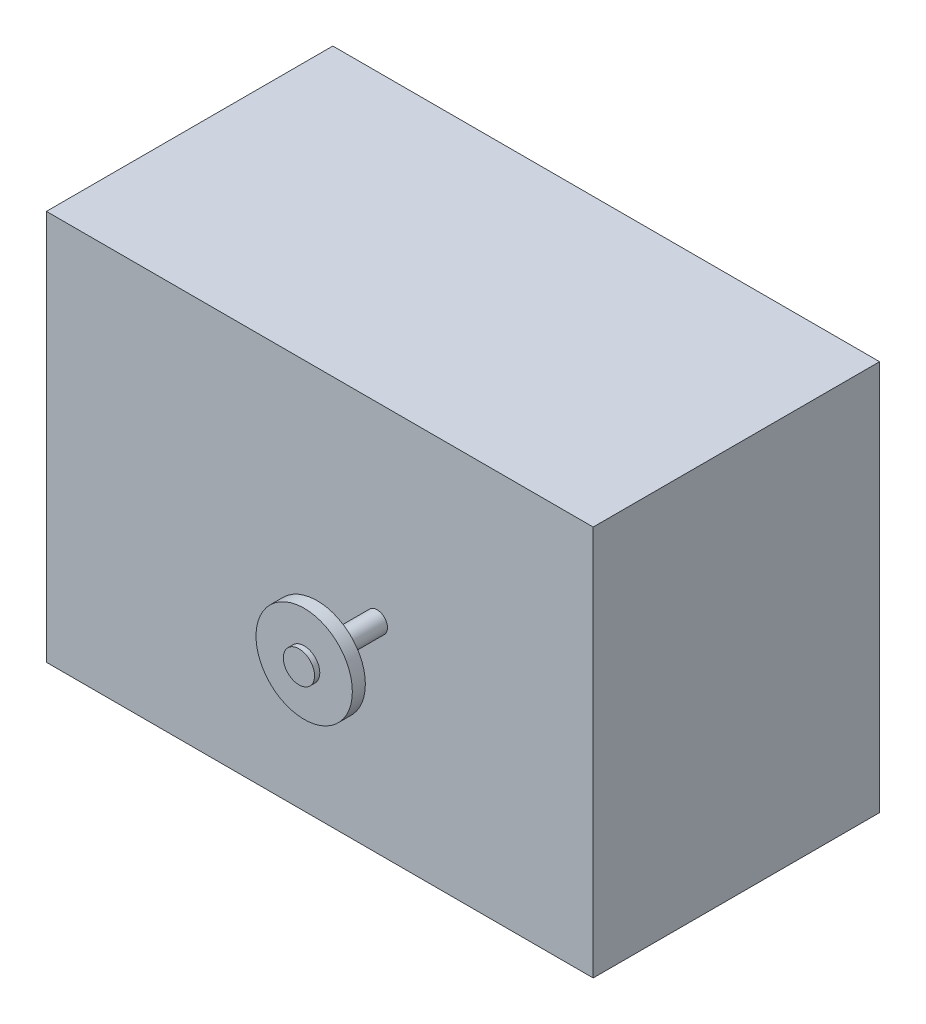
ISO-10303-21;
HEADER;
FILE_DESCRIPTION(('STEP AP214'),'2;1');
FILE_NAME('part.step','',(''),(''),'','','');
FILE_SCHEMA(('AUTOMOTIVE_DESIGN { 1 0 10303 214 1 1 1 1 }'));
ENDSEC;
DATA;
#1=APPLICATION_CONTEXT('core data for automotive mechanical design processes');
#2=APPLICATION_PROTOCOL_DEFINITION('international standard','automotive_design',2000,#1);
#3=PRODUCT_CONTEXT('',#1,'mechanical');
#4=PRODUCT('Part','Part','',(#3));
#5=PRODUCT_RELATED_PRODUCT_CATEGORY('part','',(#4));
#6=PRODUCT_DEFINITION_FORMATION('','',#4);
#7=PRODUCT_DEFINITION_CONTEXT('part definition',#1,'design');
#8=PRODUCT_DEFINITION('design','',#6,#7);
#9=PRODUCT_DEFINITION_SHAPE('','',#8);
#10=(LENGTH_UNIT() NAMED_UNIT(*) SI_UNIT(.MILLI.,.METRE.));
#11=(NAMED_UNIT(*) PLANE_ANGLE_UNIT() SI_UNIT($,.RADIAN.));
#12=(NAMED_UNIT(*) SI_UNIT($,.STERADIAN.) SOLID_ANGLE_UNIT());
#13=UNCERTAINTY_MEASURE_WITH_UNIT(LENGTH_MEASURE(1.E-05),#10,'distance_accuracy_value','');
#14=(GEOMETRIC_REPRESENTATION_CONTEXT(3) GLOBAL_UNCERTAINTY_ASSIGNED_CONTEXT((#13)) GLOBAL_UNIT_ASSIGNED_CONTEXT((#10,
#11,#12)) REPRESENTATION_CONTEXT('',''));
#15=CARTESIAN_POINT('',(0.,0.,0.));
#16=DIRECTION('',(0.,0.,1.));
#17=DIRECTION('',(1.,0.,0.));
#18=AXIS2_PLACEMENT_3D('',#15,#16,#17);
#19=CARTESIAN_POINT('',(22.,97.,50.5));
#20=DIRECTION('',(0.,0.,-1.));
#21=DIRECTION('',(-1.,0.,0.));
#22=AXIS2_PLACEMENT_3D('',#19,#20,#21);
#23=CYLINDRICAL_SURFACE('',#22,4.);
#24=CARTESIAN_POINT('',(22.,97.,22.5));
#25=DIRECTION('',(0.,0.,-1.));
#26=DIRECTION('',(-1.,0.,0.));
#27=AXIS2_PLACEMENT_3D('',#24,#25,#26);
#28=CIRCLE('',#27,4.);
#29=CARTESIAN_POINT('',(18.,97.,22.5));
#30=VERTEX_POINT('',#29);
#31=EDGE_CURVE('E111',#30,#30,#28,.F.);
#32=ORIENTED_EDGE('',*,*,#31,.T.);
#33=EDGE_LOOP('',(#32));
#34=FACE_BOUND('',#33,.T.);
#35=CARTESIAN_POINT('',(22.,97.,45.5));
#36=DIRECTION('',(0.,0.,1.));
#37=DIRECTION('',(1.,0.,0.));
#38=AXIS2_PLACEMENT_3D('',#35,#36,#37);
#39=CIRCLE('',#38,4.);
#40=CARTESIAN_POINT('',(26.,97.,45.5));
#41=VERTEX_POINT('',#40);
#42=EDGE_CURVE('E37',#41,#41,#39,.T.);
#43=ORIENTED_EDGE('',*,*,#42,.F.);
#44=EDGE_LOOP('',(#43));
#45=FACE_BOUND('',#44,.T.);
#46=ADVANCED_FACE('F33',(#34,#45),#23,.T.);
#47=CARTESIAN_POINT('',(-105.,170.,-87.5));
#48=DIRECTION('',(1.,0.,0.));
#49=DIRECTION('',(0.,0.,-1.));
#50=AXIS2_PLACEMENT_3D('',#47,#48,#49);
#51=PLANE('',#50);
#52=DIRECTION('',(0.,0.,1.));
#53=VECTOR('',#52,1.);
#54=CARTESIAN_POINT('',(-105.,20.,-87.5));
#55=LINE('',#54,#53);
#56=CARTESIAN_POINT('',(-105.,20.,-87.5));
#57=VERTEX_POINT('',#56);
#58=CARTESIAN_POINT('',(-105.,20.,22.5));
#59=VERTEX_POINT('',#58);
#60=EDGE_CURVE('E102',#57,#59,#55,.T.);
#61=ORIENTED_EDGE('',*,*,#60,.T.);
#62=DIRECTION('',(0.,-1.,0.));
#63=VECTOR('',#62,1.);
#64=CARTESIAN_POINT('',(-105.,170.,22.5));
#65=LINE('',#64,#63);
#66=CARTESIAN_POINT('',(-105.,170.,22.5));
#67=VERTEX_POINT('',#66);
#68=EDGE_CURVE('E93',#67,#59,#65,.T.);
#69=ORIENTED_EDGE('',*,*,#68,.F.);
#70=DIRECTION('',(0.,0.,1.));
#71=VECTOR('',#70,1.);
#72=CARTESIAN_POINT('',(-105.,170.,-87.5));
#73=LINE('',#72,#71);
#74=CARTESIAN_POINT('',(-105.,170.,-87.5));
#75=VERTEX_POINT('',#74);
#76=EDGE_CURVE('E87',#75,#67,#73,.T.);
#77=ORIENTED_EDGE('',*,*,#76,.F.);
#78=DIRECTION('',(0.,-1.,0.));
#79=VECTOR('',#78,1.);
#80=CARTESIAN_POINT('',(-105.,170.,-87.5));
#81=LINE('',#80,#79);
#82=EDGE_CURVE('E98',#75,#57,#81,.T.);
#83=ORIENTED_EDGE('',*,*,#82,.T.);
#84=EDGE_LOOP('',(#61,#69,#77,#83));
#85=FACE_BOUND('',#84,.T.);
#86=ADVANCED_FACE('F35',(#85),#51,.F.);
#87=CARTESIAN_POINT('',(-105.,170.,22.5));
#88=DIRECTION('',(0.,0.,-1.));
#89=DIRECTION('',(-1.,0.,0.));
#90=AXIS2_PLACEMENT_3D('',#87,#88,#89);
#91=PLANE('',#90);
#92=ORIENTED_EDGE('',*,*,#31,.F.);
#93=EDGE_LOOP('',(#92));
#94=FACE_BOUND('',#93,.T.);
#95=DIRECTION('',(1.,0.,0.));
#96=VECTOR('',#95,1.);
#97=CARTESIAN_POINT('',(-105.,20.,22.5));
#98=LINE('',#97,#96);
#99=CARTESIAN_POINT('',(105.,20.,22.5));
#100=VERTEX_POINT('',#99);
#101=EDGE_CURVE('E92',#59,#100,#98,.T.);
#102=ORIENTED_EDGE('',*,*,#101,.T.);
#103=DIRECTION('',(0.,-1.,0.));
#104=VECTOR('',#103,1.);
#105=CARTESIAN_POINT('',(105.,170.,22.5));
#106=LINE('',#105,#104);
#107=CARTESIAN_POINT('',(105.,170.,22.5));
#108=VERTEX_POINT('',#107);
#109=EDGE_CURVE('E90',#108,#100,#106,.T.);
#110=ORIENTED_EDGE('',*,*,#109,.F.);
#111=DIRECTION('',(1.,0.,0.));
#112=VECTOR('',#111,1.);
#113=CARTESIAN_POINT('',(-105.,170.,22.5));
#114=LINE('',#113,#112);
#115=EDGE_CURVE('E82',#67,#108,#114,.T.);
#116=ORIENTED_EDGE('',*,*,#115,.F.);
#117=ORIENTED_EDGE('',*,*,#68,.T.);
#118=EDGE_LOOP('',(#102,#110,#116,#117));
#119=FACE_BOUND('',#118,.T.);
#120=ADVANCED_FACE('F91',(#94,#119),#91,.F.);
#121=CARTESIAN_POINT('',(105.,170.,-87.5));
#122=DIRECTION('',(-1.,0.,0.));
#123=DIRECTION('',(0.,0.,1.));
#124=AXIS2_PLACEMENT_3D('',#121,#122,#123);
#125=PLANE('',#124);
#126=DIRECTION('',(0.,0.,-1.));
#127=VECTOR('',#126,1.);
#128=CARTESIAN_POINT('',(105.,20.,-87.5));
#129=LINE('',#128,#127);
#130=CARTESIAN_POINT('',(105.,20.,-87.5));
#131=VERTEX_POINT('',#130);
#132=EDGE_CURVE('E68',#100,#131,#129,.T.);
#133=ORIENTED_EDGE('',*,*,#132,.T.);
#134=DIRECTION('',(0.,-1.,0.));
#135=VECTOR('',#134,1.);
#136=CARTESIAN_POINT('',(105.,170.,-87.5));
#137=LINE('',#136,#135);
#138=CARTESIAN_POINT('',(105.,170.,-87.5));
#139=VERTEX_POINT('',#138);
#140=EDGE_CURVE('E94',#139,#131,#137,.T.);
#141=ORIENTED_EDGE('',*,*,#140,.F.);
#142=DIRECTION('',(0.,0.,-1.));
#143=VECTOR('',#142,1.);
#144=CARTESIAN_POINT('',(105.,170.,-87.5));
#145=LINE('',#144,#143);
#146=EDGE_CURVE('E85',#108,#139,#145,.T.);
#147=ORIENTED_EDGE('',*,*,#146,.F.);
#148=ORIENTED_EDGE('',*,*,#109,.T.);
#149=EDGE_LOOP('',(#133,#141,#147,#148));
#150=FACE_BOUND('',#149,.T.);
#151=ADVANCED_FACE('F96',(#150),#125,.F.);
#152=CARTESIAN_POINT('',(-105.,170.,-87.5));
#153=DIRECTION('',(0.,0.,1.));
#154=DIRECTION('',(1.,0.,0.));
#155=AXIS2_PLACEMENT_3D('',#152,#153,#154);
#156=PLANE('',#155);
#157=DIRECTION('',(-1.,0.,0.));
#158=VECTOR('',#157,1.);
#159=CARTESIAN_POINT('',(-105.,20.,-87.5));
#160=LINE('',#159,#158);
#161=EDGE_CURVE('E74',#131,#57,#160,.T.);
#162=ORIENTED_EDGE('',*,*,#161,.T.);
#163=ORIENTED_EDGE('',*,*,#82,.F.);
#164=DIRECTION('',(-1.,0.,0.));
#165=VECTOR('',#164,1.);
#166=CARTESIAN_POINT('',(-105.,170.,-87.5));
#167=LINE('',#166,#165);
#168=EDGE_CURVE('E51',#139,#75,#167,.T.);
#169=ORIENTED_EDGE('',*,*,#168,.F.);
#170=ORIENTED_EDGE('',*,*,#140,.T.);
#171=EDGE_LOOP('',(#162,#163,#169,#170));
#172=FACE_BOUND('',#171,.T.);
#173=ADVANCED_FACE('F134',(#172),#156,.F.);
#174=CARTESIAN_POINT('',(0.,170.,0.));
#175=DIRECTION('',(0.,1.,0.));
#176=DIRECTION('',(0.,0.,1.));
#177=AXIS2_PLACEMENT_3D('',#174,#175,#176);
#178=PLANE('',#177);
#179=ORIENTED_EDGE('',*,*,#76,.T.);
#180=ORIENTED_EDGE('',*,*,#115,.T.);
#181=ORIENTED_EDGE('',*,*,#146,.T.);
#182=ORIENTED_EDGE('',*,*,#168,.T.);
#183=EDGE_LOOP('',(#179,#180,#181,#182));
#184=FACE_BOUND('',#183,.T.);
#185=ADVANCED_FACE('F83',(#184),#178,.T.);
#186=CARTESIAN_POINT('',(0.,20.,0.));
#187=DIRECTION('',(0.,1.,0.));
#188=DIRECTION('',(0.,0.,1.));
#189=AXIS2_PLACEMENT_3D('',#186,#187,#188);
#190=PLANE('',#189);
#191=ORIENTED_EDGE('',*,*,#60,.F.);
#192=ORIENTED_EDGE('',*,*,#161,.F.);
#193=ORIENTED_EDGE('',*,*,#132,.F.);
#194=ORIENTED_EDGE('',*,*,#101,.F.);
#195=EDGE_LOOP('',(#191,#192,#193,#194));
#196=FACE_BOUND('',#195,.T.);
#197=ADVANCED_FACE('F133',(#196),#190,.F.);
#198=CARTESIAN_POINT('',(22.,97.,45.5));
#199=DIRECTION('',(0.,0.,1.));
#200=DIRECTION('',(1.,0.,0.));
#201=AXIS2_PLACEMENT_3D('',#198,#199,#200);
#202=CYLINDRICAL_SURFACE('',#201,18.5);
#203=CARTESIAN_POINT('',(22.,97.,45.5));
#204=DIRECTION('',(0.,0.,1.));
#205=DIRECTION('',(1.,0.,0.));
#206=AXIS2_PLACEMENT_3D('',#203,#204,#205);
#207=CIRCLE('',#206,18.5);
#208=CARTESIAN_POINT('',(40.5,97.,45.5));
#209=VERTEX_POINT('',#208);
#210=EDGE_CURVE('E105',#209,#209,#207,.T.);
#211=ORIENTED_EDGE('',*,*,#210,.T.);
#212=EDGE_LOOP('',(#211));
#213=FACE_BOUND('',#212,.T.);
#214=CARTESIAN_POINT('',(22.,97.,50.5));
#215=DIRECTION('',(0.,0.,1.));
#216=DIRECTION('',(1.,0.,0.));
#217=AXIS2_PLACEMENT_3D('',#214,#215,#216);
#218=CIRCLE('',#217,18.5);
#219=CARTESIAN_POINT('',(40.5,97.,50.5));
#220=VERTEX_POINT('',#219);
#221=EDGE_CURVE('E234',#220,#220,#218,.T.);
#222=ORIENTED_EDGE('',*,*,#221,.F.);
#223=EDGE_LOOP('',(#222));
#224=FACE_BOUND('',#223,.T.);
#225=ADVANCED_FACE('F137',(#213,#224),#202,.T.);
#226=CARTESIAN_POINT('',(22.,97.,45.5));
#227=DIRECTION('',(0.,0.,1.));
#228=DIRECTION('',(1.,0.,0.));
#229=AXIS2_PLACEMENT_3D('',#226,#227,#228);
#230=PLANE('',#229);
#231=ORIENTED_EDGE('',*,*,#42,.T.);
#232=EDGE_LOOP('',(#231));
#233=FACE_BOUND('',#232,.T.);
#234=ORIENTED_EDGE('',*,*,#210,.F.);
#235=EDGE_LOOP('',(#234));
#236=FACE_BOUND('',#235,.T.);
#237=ADVANCED_FACE('F118',(#233,#236),#230,.F.);
#238=CARTESIAN_POINT('',(22.,97.,50.5));
#239=DIRECTION('',(0.,0.,1.));
#240=DIRECTION('',(1.,0.,0.));
#241=AXIS2_PLACEMENT_3D('',#238,#239,#240);
#242=PLANE('',#241);
#243=CARTESIAN_POINT('',(22.,97.,50.5));
#244=DIRECTION('',(0.,0.,1.));
#245=DIRECTION('',(1.,0.,0.));
#246=AXIS2_PLACEMENT_3D('',#243,#244,#245);
#247=CIRCLE('',#246,6.);
#248=CARTESIAN_POINT('',(28.,97.,50.5));
#249=VERTEX_POINT('',#248);
#250=EDGE_CURVE('E11',#249,#249,#247,.T.);
#251=ORIENTED_EDGE('',*,*,#250,.F.);
#252=EDGE_LOOP('',(#251));
#253=FACE_BOUND('',#252,.T.);
#254=ORIENTED_EDGE('',*,*,#221,.T.);
#255=EDGE_LOOP('',(#254));
#256=FACE_BOUND('',#255,.T.);
#257=ADVANCED_FACE('F129',(#253,#256),#242,.T.);
#258=CARTESIAN_POINT('',(22.,97.,52.5));
#259=DIRECTION('',(0.,0.,-1.));
#260=DIRECTION('',(-1.,0.,0.));
#261=AXIS2_PLACEMENT_3D('',#258,#259,#260);
#262=CYLINDRICAL_SURFACE('',#261,6.);
#263=CARTESIAN_POINT('',(22.,97.,52.5));
#264=DIRECTION('',(0.,0.,1.));
#265=DIRECTION('',(1.,0.,0.));
#266=AXIS2_PLACEMENT_3D('',#263,#264,#265);
#267=CIRCLE('',#266,6.);
#268=CARTESIAN_POINT('',(28.,97.,52.5));
#269=VERTEX_POINT('',#268);
#270=EDGE_CURVE('E233',#269,#269,#267,.T.);
#271=ORIENTED_EDGE('',*,*,#270,.F.);
#272=EDGE_LOOP('',(#271));
#273=FACE_BOUND('',#272,.T.);
#274=ORIENTED_EDGE('',*,*,#250,.T.);
#275=EDGE_LOOP('',(#274));
#276=FACE_BOUND('',#275,.T.);
#277=ADVANCED_FACE('F190',(#273,#276),#262,.T.);
#278=CARTESIAN_POINT('',(22.,97.,52.5));
#279=DIRECTION('',(0.,0.,1.));
#280=DIRECTION('',(1.,0.,0.));
#281=AXIS2_PLACEMENT_3D('',#278,#279,#280);
#282=PLANE('',#281);
#283=ORIENTED_EDGE('',*,*,#270,.T.);
#284=EDGE_LOOP('',(#283));
#285=FACE_BOUND('',#284,.T.);
#286=ADVANCED_FACE('F197',(#285),#282,.T.);
#287=CLOSED_SHELL('',(#46,#86,#120,#151,#173,#185,#197,#225,#237,#257,#277,#286));
#288=MANIFOLD_SOLID_BREP('B2',#287);
#289=ADVANCED_BREP_SHAPE_REPRESENTATION('',(#18,#288),#14);
#290=SHAPE_DEFINITION_REPRESENTATION(#9,#289);
ENDSEC;
END-ISO-10303-21;
